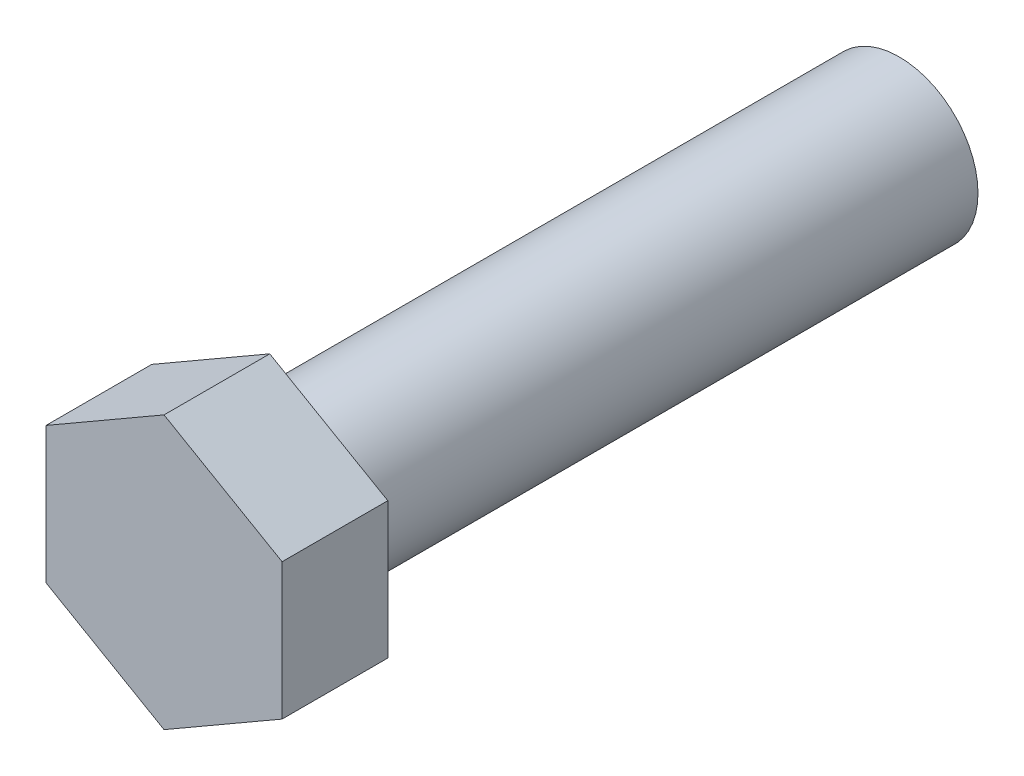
from build123d import *

# Parameters (mm, degrees)
BOLT_HEAD_DEPTH = 68.2625
SK_BODY_R       = 50.8
BOLT_BODY_DEPTH = 406.4


with BuildPart() as part:
    # Sketch3 → bolt Head (new body)
    with BuildSketch(Plane(origin=(0, 0, 0), x_dir=(0, 1, 0), z_dir=(0, 0, 1))):
        Polygon((87.988181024, 0), (43.994090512, 76.2), (-43.994090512, 76.2), (-87.988181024, 0), (-43.994090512, -76.2), (43.994090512, -76.2), align=None)
    extrude(amount=BOLT_HEAD_DEPTH)

    # sk body → bolt Body (add)
    with BuildSketch(Plane(origin=(0, 0, 0), x_dir=(0, 1, 0), z_dir=(0, 0, 1))):
        with Locations(Location((0, 0, 0), (0, 0, 270))):
            Circle(SK_BODY_R)
    extrude(amount=-BOLT_BODY_DEPTH)


solid = part.part
